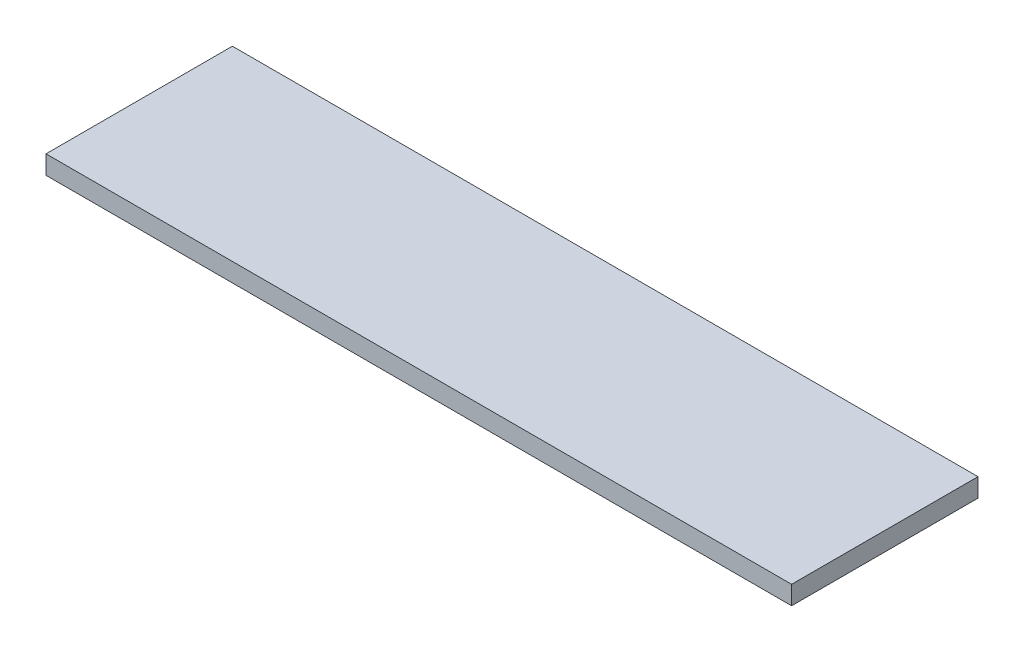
ISO-10303-21;
HEADER;
FILE_DESCRIPTION(('STEP AP214'),'2;1');
FILE_NAME('part.step','',(''),(''),'','','');
FILE_SCHEMA(('AUTOMOTIVE_DESIGN { 1 0 10303 214 1 1 1 1 }'));
ENDSEC;
DATA;
#1=APPLICATION_CONTEXT('core data for automotive mechanical design processes');
#2=APPLICATION_PROTOCOL_DEFINITION('international standard','automotive_design',2000,#1);
#3=PRODUCT_CONTEXT('',#1,'mechanical');
#4=PRODUCT('Part','Part','',(#3));
#5=PRODUCT_RELATED_PRODUCT_CATEGORY('part','',(#4));
#6=PRODUCT_DEFINITION_FORMATION('','',#4);
#7=PRODUCT_DEFINITION_CONTEXT('part definition',#1,'design');
#8=PRODUCT_DEFINITION('design','',#6,#7);
#9=PRODUCT_DEFINITION_SHAPE('','',#8);
#10=(LENGTH_UNIT() NAMED_UNIT(*) SI_UNIT(.MILLI.,.METRE.));
#11=(NAMED_UNIT(*) PLANE_ANGLE_UNIT() SI_UNIT($,.RADIAN.));
#12=(NAMED_UNIT(*) SI_UNIT($,.STERADIAN.) SOLID_ANGLE_UNIT());
#13=UNCERTAINTY_MEASURE_WITH_UNIT(LENGTH_MEASURE(1.E-05),#10,'distance_accuracy_value','');
#14=(GEOMETRIC_REPRESENTATION_CONTEXT(3) GLOBAL_UNCERTAINTY_ASSIGNED_CONTEXT((#13)) GLOBAL_UNIT_ASSIGNED_CONTEXT((#10,
#11,#12)) REPRESENTATION_CONTEXT('',''));
#15=CARTESIAN_POINT('',(0.,0.,0.));
#16=DIRECTION('',(0.,0.,1.));
#17=DIRECTION('',(1.,0.,0.));
#18=AXIS2_PLACEMENT_3D('',#15,#16,#17);
#19=CARTESIAN_POINT('',(0.,5.08,0.));
#20=DIRECTION('',(1.,0.,0.));
#21=DIRECTION('',(0.,0.,-1.));
#22=AXIS2_PLACEMENT_3D('',#19,#20,#21);
#23=PLANE('',#22);
#24=DIRECTION('',(0.,0.,1.));
#25=VECTOR('',#24,1.);
#26=CARTESIAN_POINT('',(0.,0.,0.));
#27=LINE('',#26,#25);
#28=CARTESIAN_POINT('',(0.,0.,-50.8));
#29=VERTEX_POINT('',#28);
#30=CARTESIAN_POINT('',(0.,0.,0.));
#31=VERTEX_POINT('',#30);
#32=EDGE_CURVE('E95',#29,#31,#27,.T.);
#33=ORIENTED_EDGE('',*,*,#32,.T.);
#34=DIRECTION('',(0.,-1.,0.));
#35=VECTOR('',#34,1.);
#36=CARTESIAN_POINT('',(0.,5.08,0.));
#37=LINE('',#36,#35);
#38=CARTESIAN_POINT('',(0.,5.08,0.));
#39=VERTEX_POINT('',#38);
#40=EDGE_CURVE('E11',#39,#31,#37,.T.);
#41=ORIENTED_EDGE('',*,*,#40,.F.);
#42=DIRECTION('',(0.,0.,1.));
#43=VECTOR('',#42,1.);
#44=CARTESIAN_POINT('',(0.,5.08,0.));
#45=LINE('',#44,#43);
#46=CARTESIAN_POINT('',(0.,5.08,-50.8));
#47=VERTEX_POINT('',#46);
#48=EDGE_CURVE('E83',#47,#39,#45,.T.);
#49=ORIENTED_EDGE('',*,*,#48,.F.);
#50=DIRECTION('',(0.,-1.,0.));
#51=VECTOR('',#50,1.);
#52=CARTESIAN_POINT('',(0.,5.08,-50.8));
#53=LINE('',#52,#51);
#54=EDGE_CURVE('E91',#47,#29,#53,.T.);
#55=ORIENTED_EDGE('',*,*,#54,.T.);
#56=EDGE_LOOP('',(#33,#41,#49,#55));
#57=FACE_BOUND('',#56,.T.);
#58=ADVANCED_FACE('F32',(#57),#23,.F.);
#59=CARTESIAN_POINT('',(0.,5.08,0.));
#60=DIRECTION('',(0.,0.,-1.));
#61=DIRECTION('',(-1.,0.,0.));
#62=AXIS2_PLACEMENT_3D('',#59,#60,#61);
#63=PLANE('',#62);
#64=DIRECTION('',(1.,0.,0.));
#65=VECTOR('',#64,1.);
#66=CARTESIAN_POINT('',(0.,0.,0.));
#67=LINE('',#66,#65);
#68=CARTESIAN_POINT('',(203.2,0.,0.));
#69=VERTEX_POINT('',#68);
#70=EDGE_CURVE('E87',#31,#69,#67,.T.);
#71=ORIENTED_EDGE('',*,*,#70,.T.);
#72=DIRECTION('',(0.,-1.,0.));
#73=VECTOR('',#72,1.);
#74=CARTESIAN_POINT('',(203.2,5.08,0.));
#75=LINE('',#74,#73);
#76=CARTESIAN_POINT('',(203.2,5.08,0.));
#77=VERTEX_POINT('',#76);
#78=EDGE_CURVE('E40',#77,#69,#75,.T.);
#79=ORIENTED_EDGE('',*,*,#78,.F.);
#80=DIRECTION('',(1.,0.,0.));
#81=VECTOR('',#80,1.);
#82=CARTESIAN_POINT('',(0.,5.08,0.));
#83=LINE('',#82,#81);
#84=EDGE_CURVE('E78',#39,#77,#83,.T.);
#85=ORIENTED_EDGE('',*,*,#84,.F.);
#86=ORIENTED_EDGE('',*,*,#40,.T.);
#87=EDGE_LOOP('',(#71,#79,#85,#86));
#88=FACE_BOUND('',#87,.T.);
#89=ADVANCED_FACE('F86',(#88),#63,.F.);
#90=CARTESIAN_POINT('',(203.2,5.08,0.));
#91=DIRECTION('',(-1.,0.,0.));
#92=DIRECTION('',(0.,0.,1.));
#93=AXIS2_PLACEMENT_3D('',#90,#91,#92);
#94=PLANE('',#93);
#95=DIRECTION('',(0.,0.,-1.));
#96=VECTOR('',#95,1.);
#97=CARTESIAN_POINT('',(203.2,0.,0.));
#98=LINE('',#97,#96);
#99=CARTESIAN_POINT('',(203.2,0.,-50.8));
#100=VERTEX_POINT('',#99);
#101=EDGE_CURVE('E65',#69,#100,#98,.T.);
#102=ORIENTED_EDGE('',*,*,#101,.T.);
#103=DIRECTION('',(0.,-1.,0.));
#104=VECTOR('',#103,1.);
#105=CARTESIAN_POINT('',(203.2,5.08,-50.8));
#106=LINE('',#105,#104);
#107=CARTESIAN_POINT('',(203.2,5.08,-50.8));
#108=VERTEX_POINT('',#107);
#109=EDGE_CURVE('E88',#108,#100,#106,.T.);
#110=ORIENTED_EDGE('',*,*,#109,.F.);
#111=DIRECTION('',(0.,0.,-1.));
#112=VECTOR('',#111,1.);
#113=CARTESIAN_POINT('',(203.2,5.08,0.));
#114=LINE('',#113,#112);
#115=EDGE_CURVE('E81',#77,#108,#114,.T.);
#116=ORIENTED_EDGE('',*,*,#115,.F.);
#117=ORIENTED_EDGE('',*,*,#78,.T.);
#118=EDGE_LOOP('',(#102,#110,#116,#117));
#119=FACE_BOUND('',#118,.T.);
#120=ADVANCED_FACE('F89',(#119),#94,.F.);
#121=CARTESIAN_POINT('',(0.,5.08,-50.8));
#122=DIRECTION('',(0.,0.,1.));
#123=DIRECTION('',(1.,0.,0.));
#124=AXIS2_PLACEMENT_3D('',#121,#122,#123);
#125=PLANE('',#124);
#126=DIRECTION('',(-1.,0.,0.));
#127=VECTOR('',#126,1.);
#128=CARTESIAN_POINT('',(0.,0.,-50.8));
#129=LINE('',#128,#127);
#130=EDGE_CURVE('E71',#100,#29,#129,.T.);
#131=ORIENTED_EDGE('',*,*,#130,.T.);
#132=ORIENTED_EDGE('',*,*,#54,.F.);
#133=DIRECTION('',(-1.,0.,0.));
#134=VECTOR('',#133,1.);
#135=CARTESIAN_POINT('',(0.,5.08,-50.8));
#136=LINE('',#135,#134);
#137=EDGE_CURVE('E48',#108,#47,#136,.T.);
#138=ORIENTED_EDGE('',*,*,#137,.F.);
#139=ORIENTED_EDGE('',*,*,#109,.T.);
#140=EDGE_LOOP('',(#131,#132,#138,#139));
#141=FACE_BOUND('',#140,.T.);
#142=ADVANCED_FACE('F102',(#141),#125,.F.);
#143=CARTESIAN_POINT('',(0.,5.08,-50.8));
#144=DIRECTION('',(0.,-1.,0.));
#145=DIRECTION('',(0.,0.,-1.));
#146=AXIS2_PLACEMENT_3D('',#143,#144,#145);
#147=PLANE('',#146);
#148=ORIENTED_EDGE('',*,*,#48,.T.);
#149=ORIENTED_EDGE('',*,*,#84,.T.);
#150=ORIENTED_EDGE('',*,*,#115,.T.);
#151=ORIENTED_EDGE('',*,*,#137,.T.);
#152=EDGE_LOOP('',(#148,#149,#150,#151));
#153=FACE_BOUND('',#152,.T.);
#154=ADVANCED_FACE('F79',(#153),#147,.F.);
#155=CARTESIAN_POINT('',(0.,0.,-50.8));
#156=DIRECTION('',(0.,-1.,0.));
#157=DIRECTION('',(0.,0.,-1.));
#158=AXIS2_PLACEMENT_3D('',#155,#156,#157);
#159=PLANE('',#158);
#160=ORIENTED_EDGE('',*,*,#32,.F.);
#161=ORIENTED_EDGE('',*,*,#130,.F.);
#162=ORIENTED_EDGE('',*,*,#101,.F.);
#163=ORIENTED_EDGE('',*,*,#70,.F.);
#164=EDGE_LOOP('',(#160,#161,#162,#163));
#165=FACE_BOUND('',#164,.T.);
#166=ADVANCED_FACE('F105',(#165),#159,.T.);
#167=CLOSED_SHELL('',(#58,#89,#120,#142,#154,#166));
#168=MANIFOLD_SOLID_BREP('B2',#167);
#169=ADVANCED_BREP_SHAPE_REPRESENTATION('',(#18,#168),#14);
#170=SHAPE_DEFINITION_REPRESENTATION(#9,#169);
ENDSEC;
END-ISO-10303-21;
